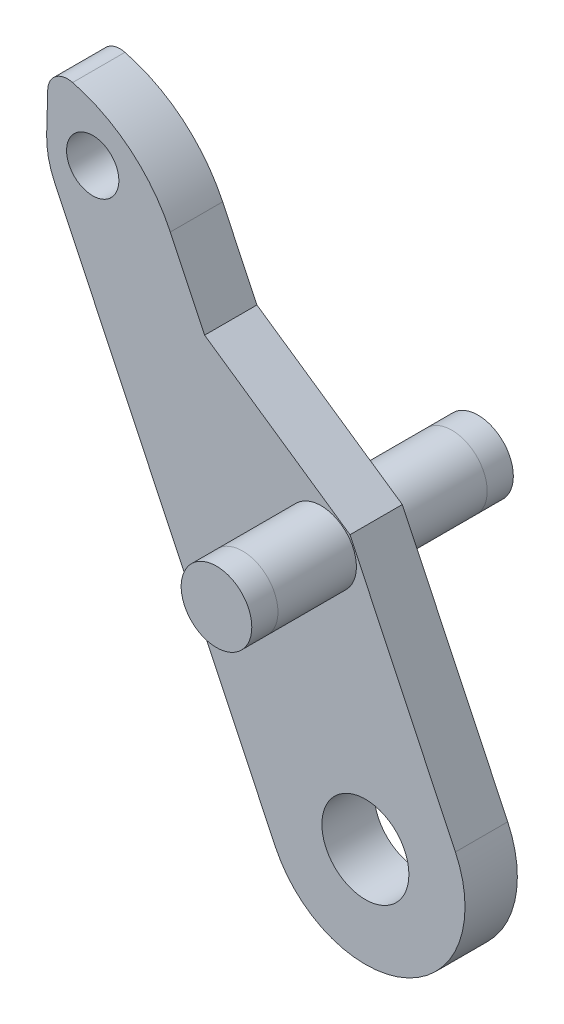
ISO-10303-21;
HEADER;
FILE_DESCRIPTION(('STEP AP214'),'2;1');
FILE_NAME('part.step','',(''),(''),'','','');
FILE_SCHEMA(('AUTOMOTIVE_DESIGN { 1 0 10303 214 1 1 1 1 }'));
ENDSEC;
DATA;
#1=APPLICATION_CONTEXT('core data for automotive mechanical design processes');
#2=APPLICATION_PROTOCOL_DEFINITION('international standard','automotive_design',2000,#1);
#3=PRODUCT_CONTEXT('',#1,'mechanical');
#4=PRODUCT('Part','Part','',(#3));
#5=PRODUCT_RELATED_PRODUCT_CATEGORY('part','',(#4));
#6=PRODUCT_DEFINITION_FORMATION('','',#4);
#7=PRODUCT_DEFINITION_CONTEXT('part definition',#1,'design');
#8=PRODUCT_DEFINITION('design','',#6,#7);
#9=PRODUCT_DEFINITION_SHAPE('','',#8);
#10=(LENGTH_UNIT() NAMED_UNIT(*) SI_UNIT(.MILLI.,.METRE.));
#11=(NAMED_UNIT(*) PLANE_ANGLE_UNIT() SI_UNIT($,.RADIAN.));
#12=(NAMED_UNIT(*) SI_UNIT($,.STERADIAN.) SOLID_ANGLE_UNIT());
#13=UNCERTAINTY_MEASURE_WITH_UNIT(LENGTH_MEASURE(1.E-05),#10,'distance_accuracy_value','');
#14=(GEOMETRIC_REPRESENTATION_CONTEXT(3) GLOBAL_UNCERTAINTY_ASSIGNED_CONTEXT((#13)) GLOBAL_UNIT_ASSIGNED_CONTEXT((#10,
#11,#12)) REPRESENTATION_CONTEXT('',''));
#15=CARTESIAN_POINT('',(0.,0.,0.));
#16=DIRECTION('',(0.,0.,1.));
#17=DIRECTION('',(1.,0.,0.));
#18=AXIS2_PLACEMENT_3D('',#15,#16,#17);
#19=CARTESIAN_POINT('',(101.996136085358,29.1759008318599,-5.));
#20=DIRECTION('',(0.,0.,1.));
#21=DIRECTION('',(1.,0.,0.));
#22=AXIS2_PLACEMENT_3D('',#19,#20,#21);
#23=CYLINDRICAL_SURFACE('',#22,1.35000000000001);
#24=CARTESIAN_POINT('',(101.996136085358,29.1759008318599,5.));
#25=DIRECTION('',(0.,0.,1.));
#26=DIRECTION('',(1.,0.,0.));
#27=AXIS2_PLACEMENT_3D('',#24,#25,#26);
#28=CIRCLE('',#27,1.35000000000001);
#29=CARTESIAN_POINT('',(103.346136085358,29.1759008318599,5.));
#30=VERTEX_POINT('',#29);
#31=EDGE_CURVE('E274',#30,#30,#28,.T.);
#32=ORIENTED_EDGE('',*,*,#31,.F.);
#33=EDGE_LOOP('',(#32));
#34=FACE_BOUND('',#33,.T.);
#35=CARTESIAN_POINT('',(101.996136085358,29.1759008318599,4.));
#36=DIRECTION('',(0.,0.,-1.));
#37=DIRECTION('',(0.,1.,0.));
#38=AXIS2_PLACEMENT_3D('',#35,#36,#37);
#39=CIRCLE('',#38,1.35000000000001);
#40=CARTESIAN_POINT('',(101.996136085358,30.5259008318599,4.));
#41=VERTEX_POINT('',#40);
#42=EDGE_CURVE('E11',#41,#41,#39,.F.);
#43=ORIENTED_EDGE('',*,*,#42,.T.);
#44=EDGE_LOOP('',(#43));
#45=FACE_BOUND('',#44,.T.);
#46=ADVANCED_FACE('F34',(#34,#45),#23,.T.);
#47=CARTESIAN_POINT('',(101.996136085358,29.1759008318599,-1.));
#48=DIRECTION('',(0.,0.,1.));
#49=DIRECTION('',(1.,0.,0.));
#50=AXIS2_PLACEMENT_3D('',#47,#48,#49);
#51=CIRCLE('',#50,1.35000000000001);
#52=CARTESIAN_POINT('',(103.346136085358,29.1759008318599,-1.));
#53=VERTEX_POINT('',#52);
#54=EDGE_CURVE('E176',#53,#53,#51,.T.);
#55=ORIENTED_EDGE('',*,*,#54,.F.);
#56=EDGE_LOOP('',(#55));
#57=FACE_BOUND('',#56,.T.);
#58=CARTESIAN_POINT('',(101.996136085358,29.1759008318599,-4.));
#59=DIRECTION('',(0.,0.,-1.));
#60=DIRECTION('',(0.,1.,0.));
#61=AXIS2_PLACEMENT_3D('',#58,#59,#60);
#62=CIRCLE('',#61,1.35000000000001);
#63=CARTESIAN_POINT('',(101.996136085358,30.5259008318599,-4.));
#64=VERTEX_POINT('',#63);
#65=EDGE_CURVE('E44',#64,#64,#62,.F.);
#66=ORIENTED_EDGE('',*,*,#65,.T.);
#67=EDGE_LOOP('',(#66));
#68=FACE_BOUND('',#67,.T.);
#69=ADVANCED_FACE('F242',(#57,#68),#23,.T.);
#70=CARTESIAN_POINT('',(91.0686021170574,34.2536540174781,1.));
#71=DIRECTION('',(0.,0.,1.));
#72=DIRECTION('',(1.,0.,0.));
#73=AXIS2_PLACEMENT_3D('',#70,#71,#72);
#74=PLANE('',#73);
#75=CARTESIAN_POINT('',(101.996136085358,29.1759008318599,1.));
#76=DIRECTION('',(0.,0.,1.));
#77=DIRECTION('',(1.,0.,0.));
#78=AXIS2_PLACEMENT_3D('',#75,#76,#77);
#79=CIRCLE('',#78,1.35000000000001);
#80=CARTESIAN_POINT('',(103.346136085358,29.1759008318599,1.));
#81=VERTEX_POINT('',#80);
#82=EDGE_CURVE('E175',#81,#81,#79,.T.);
#83=ORIENTED_EDGE('',*,*,#82,.F.);
#84=EDGE_LOOP('',(#83));
#85=FACE_BOUND('',#84,.T.);
#86=CARTESIAN_POINT('',(93.2637918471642,37.4210984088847,1.));
#87=DIRECTION('',(0.,0.,1.));
#88=DIRECTION('',(1.,0.,0.));
#89=AXIS2_PLACEMENT_3D('',#86,#87,#88);
#90=CIRCLE('',#89,0.999999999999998);
#91=CARTESIAN_POINT('',(94.2637918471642,37.4210984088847,1.));
#92=VERTEX_POINT('',#91);
#93=EDGE_CURVE('E178',#92,#92,#90,.T.);
#94=ORIENTED_EDGE('',*,*,#93,.F.);
#95=EDGE_LOOP('',(#94));
#96=FACE_BOUND('',#95,.T.);
#97=DIRECTION('',(-0.428935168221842,0.903335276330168,0.));
#98=VECTOR('',#97,1.);
#99=CARTESIAN_POINT('',(97.5421933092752,33.9439958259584,1.));
#100=LINE('',#99,#98);
#101=CARTESIAN_POINT('',(97.5421933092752,33.9439958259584,1.));
#102=VERTEX_POINT('',#101);
#103=CARTESIAN_POINT('',(96.2311632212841,36.7050185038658,1.));
#104=VERTEX_POINT('',#103);
#105=EDGE_CURVE('E157',#102,#104,#100,.T.);
#106=ORIENTED_EDGE('',*,*,#105,.T.);
#107=CARTESIAN_POINT('',(91.0686021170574,34.2536540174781,1.));
#108=DIRECTION('',(0.,0.,1.));
#109=DIRECTION('',(1.,0.,0.));
#110=AXIS2_PLACEMENT_3D('',#107,#108,#109);
#111=CIRCLE('',#110,5.71499999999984);
#112=CARTESIAN_POINT('',(92.496466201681,39.7874076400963,1.));
#113=VERTEX_POINT('',#112);
#114=EDGE_CURVE('E99',#104,#113,#111,.T.);
#115=ORIENTED_EDGE('',*,*,#114,.T.);
#116=CARTESIAN_POINT('',(92.3060843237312,39.0495738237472,1.));
#117=DIRECTION('',(0.,0.,1.));
#118=DIRECTION('',(1.,0.,0.));
#119=AXIS2_PLACEMENT_3D('',#116,#117,#118);
#120=CIRCLE('',#119,0.762000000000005);
#121=CARTESIAN_POINT('',(91.5443814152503,39.070850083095,1.));
#122=VERTEX_POINT('',#121);
#123=EDGE_CURVE('E205',#113,#122,#120,.T.);
#124=ORIENTED_EDGE('',*,*,#123,.T.);
#125=DIRECTION('',(-0.0279216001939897,-0.999610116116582,0.));
#126=VECTOR('',#125,1.);
#127=CARTESIAN_POINT('',(91.5443814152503,39.070850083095,1.));
#128=LINE('',#127,#126);
#129=CARTESIAN_POINT('',(91.5027565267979,37.580653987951,1.));
#130=VERTEX_POINT('',#129);
#131=EDGE_CURVE('E207',#122,#130,#128,.T.);
#132=ORIENTED_EDGE('',*,*,#131,.T.);
#133=CARTESIAN_POINT('',(94.6765186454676,37.4920029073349,1.));
#134=DIRECTION('',(0.,0.,1.));
#135=DIRECTION('',(1.,0.,0.));
#136=AXIS2_PLACEMENT_3D('',#133,#134,#135);
#137=CIRCLE('',#136,3.17499999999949);
#138=CARTESIAN_POINT('',(91.8084291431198,36.1301337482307,1.));
#139=VERTEX_POINT('',#138);
#140=EDGE_CURVE('E209',#130,#139,#137,.T.);
#141=ORIENTED_EDGE('',*,*,#140,.T.);
#142=DIRECTION('',(0.42893516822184,-0.903335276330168,0.));
#143=VECTOR('',#142,1.);
#144=CARTESIAN_POINT('',(91.8084291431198,36.1301337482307,1.));
#145=LINE('',#144,#143);
#146=CARTESIAN_POINT('',(100.247397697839,18.3577090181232,1.));
#147=VERTEX_POINT('',#146);
#148=EDGE_CURVE('E122',#139,#147,#145,.T.);
#149=ORIENTED_EDGE('',*,*,#148,.T.);
#150=CARTESIAN_POINT('',(103.689105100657,19.9919520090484,1.));
#151=DIRECTION('',(0.,0.,1.));
#152=DIRECTION('',(1.,0.,0.));
#153=AXIS2_PLACEMENT_3D('',#150,#151,#152);
#154=CIRCLE('',#153,3.80999999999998);
#155=CARTESIAN_POINT('',(107.130812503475,21.6261949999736,1.));
#156=VERTEX_POINT('',#155);
#157=EDGE_CURVE('E115',#147,#156,#154,.T.);
#158=ORIENTED_EDGE('',*,*,#157,.T.);
#159=DIRECTION('',(-0.428935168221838,0.90333527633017,0.));
#160=VECTOR('',#159,1.);
#161=CARTESIAN_POINT('',(107.130812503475,21.6261949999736,1.));
#162=LINE('',#161,#160);
#163=CARTESIAN_POINT('',(103.099679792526,30.1157399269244,1.));
#164=VERTEX_POINT('',#163);
#165=EDGE_CURVE('E120',#156,#164,#162,.T.);
#166=ORIENTED_EDGE('',*,*,#165,.T.);
#167=DIRECTION('',(-0.823523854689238,0.567281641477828,0.));
#168=VECTOR('',#167,1.);
#169=CARTESIAN_POINT('',(103.099679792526,30.1157399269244,1.));
#170=LINE('',#169,#168);
#171=EDGE_CURVE('E52',#164,#102,#170,.T.);
#172=ORIENTED_EDGE('',*,*,#171,.T.);
#173=EDGE_LOOP('',(#106,#115,#124,#132,#141,#149,#158,#166,#172));
#174=FACE_BOUND('',#173,.T.);
#175=CARTESIAN_POINT('',(103.689105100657,19.9919520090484,1.));
#176=DIRECTION('',(0.,0.,1.));
#177=DIRECTION('',(1.,0.,0.));
#178=AXIS2_PLACEMENT_3D('',#175,#176,#177);
#179=CIRCLE('',#178,1.6637);
#180=CARTESIAN_POINT('',(105.352805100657,19.9919520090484,1.));
#181=VERTEX_POINT('',#180);
#182=EDGE_CURVE('E144',#181,#181,#179,.T.);
#183=ORIENTED_EDGE('',*,*,#182,.F.);
#184=EDGE_LOOP('',(#183));
#185=FACE_BOUND('',#184,.T.);
#186=ADVANCED_FACE('F117',(#85,#96,#174,#185),#74,.T.);
#187=CARTESIAN_POINT('',(91.0686021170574,34.2536540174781,-1.));
#188=DIRECTION('',(0.,0.,1.));
#189=DIRECTION('',(1.,0.,0.));
#190=AXIS2_PLACEMENT_3D('',#187,#188,#189);
#191=PLANE('',#190);
#192=ORIENTED_EDGE('',*,*,#54,.T.);
#193=EDGE_LOOP('',(#192));
#194=FACE_BOUND('',#193,.T.);
#195=CARTESIAN_POINT('',(93.2637918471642,37.4210984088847,-1.));
#196=DIRECTION('',(0.,0.,1.));
#197=DIRECTION('',(1.,0.,0.));
#198=AXIS2_PLACEMENT_3D('',#195,#196,#197);
#199=CIRCLE('',#198,0.999999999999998);
#200=CARTESIAN_POINT('',(94.2637918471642,37.4210984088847,-1.));
#201=VERTEX_POINT('',#200);
#202=EDGE_CURVE('E193',#201,#201,#199,.T.);
#203=ORIENTED_EDGE('',*,*,#202,.T.);
#204=EDGE_LOOP('',(#203));
#205=FACE_BOUND('',#204,.T.);
#206=DIRECTION('',(-0.428935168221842,0.903335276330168,0.));
#207=VECTOR('',#206,1.);
#208=CARTESIAN_POINT('',(97.5421933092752,33.9439958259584,-1.));
#209=LINE('',#208,#207);
#210=CARTESIAN_POINT('',(97.5421933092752,33.9439958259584,-1.));
#211=VERTEX_POINT('',#210);
#212=CARTESIAN_POINT('',(96.2311632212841,36.7050185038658,-1.));
#213=VERTEX_POINT('',#212);
#214=EDGE_CURVE('E140',#211,#213,#209,.T.);
#215=ORIENTED_EDGE('',*,*,#214,.F.);
#216=DIRECTION('',(-0.823523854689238,0.567281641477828,0.));
#217=VECTOR('',#216,1.);
#218=CARTESIAN_POINT('',(103.099679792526,30.1157399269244,-1.));
#219=LINE('',#218,#217);
#220=CARTESIAN_POINT('',(103.099679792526,30.1157399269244,-1.));
#221=VERTEX_POINT('',#220);
#222=EDGE_CURVE('E90',#221,#211,#219,.T.);
#223=ORIENTED_EDGE('',*,*,#222,.F.);
#224=DIRECTION('',(-0.428935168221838,0.90333527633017,0.));
#225=VECTOR('',#224,1.);
#226=CARTESIAN_POINT('',(107.130812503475,21.6261949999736,-1.));
#227=LINE('',#226,#225);
#228=CARTESIAN_POINT('',(107.130812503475,21.6261949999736,-1.));
#229=VERTEX_POINT('',#228);
#230=EDGE_CURVE('E84',#229,#221,#227,.T.);
#231=ORIENTED_EDGE('',*,*,#230,.F.);
#232=CARTESIAN_POINT('',(103.689105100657,19.9919520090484,-1.));
#233=DIRECTION('',(0.,0.,1.));
#234=DIRECTION('',(1.,0.,0.));
#235=AXIS2_PLACEMENT_3D('',#232,#233,#234);
#236=CIRCLE('',#235,3.80999999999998);
#237=CARTESIAN_POINT('',(100.247397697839,18.3577090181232,-1.));
#238=VERTEX_POINT('',#237);
#239=EDGE_CURVE('E130',#238,#229,#236,.T.);
#240=ORIENTED_EDGE('',*,*,#239,.F.);
#241=DIRECTION('',(0.42893516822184,-0.903335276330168,0.));
#242=VECTOR('',#241,1.);
#243=CARTESIAN_POINT('',(91.8084291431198,36.1301337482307,-1.));
#244=LINE('',#243,#242);
#245=CARTESIAN_POINT('',(91.8084291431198,36.1301337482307,-1.));
#246=VERTEX_POINT('',#245);
#247=EDGE_CURVE('E152',#246,#238,#244,.T.);
#248=ORIENTED_EDGE('',*,*,#247,.F.);
#249=CARTESIAN_POINT('',(94.6765186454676,37.4920029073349,-1.));
#250=DIRECTION('',(0.,0.,1.));
#251=DIRECTION('',(1.,0.,0.));
#252=AXIS2_PLACEMENT_3D('',#249,#250,#251);
#253=CIRCLE('',#252,3.17499999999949);
#254=CARTESIAN_POINT('',(91.5027565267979,37.580653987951,-1.));
#255=VERTEX_POINT('',#254);
#256=EDGE_CURVE('E150',#255,#246,#253,.T.);
#257=ORIENTED_EDGE('',*,*,#256,.F.);
#258=DIRECTION('',(-0.0279216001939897,-0.999610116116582,0.));
#259=VECTOR('',#258,1.);
#260=CARTESIAN_POINT('',(91.5443814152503,39.070850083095,-1.));
#261=LINE('',#260,#259);
#262=CARTESIAN_POINT('',(91.5443814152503,39.070850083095,-1.));
#263=VERTEX_POINT('',#262);
#264=EDGE_CURVE('E148',#263,#255,#261,.T.);
#265=ORIENTED_EDGE('',*,*,#264,.F.);
#266=CARTESIAN_POINT('',(92.3060843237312,39.0495738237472,-1.));
#267=DIRECTION('',(0.,0.,1.));
#268=DIRECTION('',(1.,0.,0.));
#269=AXIS2_PLACEMENT_3D('',#266,#267,#268);
#270=CIRCLE('',#269,0.762000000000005);
#271=CARTESIAN_POINT('',(92.496466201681,39.7874076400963,-1.));
#272=VERTEX_POINT('',#271);
#273=EDGE_CURVE('E146',#272,#263,#270,.T.);
#274=ORIENTED_EDGE('',*,*,#273,.F.);
#275=CARTESIAN_POINT('',(91.0686021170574,34.2536540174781,-1.));
#276=DIRECTION('',(0.,0.,1.));
#277=DIRECTION('',(1.,0.,0.));
#278=AXIS2_PLACEMENT_3D('',#275,#276,#277);
#279=CIRCLE('',#278,5.71499999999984);
#280=EDGE_CURVE('E143',#213,#272,#279,.T.);
#281=ORIENTED_EDGE('',*,*,#280,.F.);
#282=EDGE_LOOP('',(#215,#223,#231,#240,#248,#257,#265,#274,#281));
#283=FACE_BOUND('',#282,.T.);
#284=CARTESIAN_POINT('',(103.689105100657,19.9919520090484,-1.));
#285=DIRECTION('',(0.,0.,1.));
#286=DIRECTION('',(1.,0.,0.));
#287=AXIS2_PLACEMENT_3D('',#284,#285,#286);
#288=CIRCLE('',#287,1.6637);
#289=CARTESIAN_POINT('',(105.352805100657,19.9919520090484,-1.));
#290=VERTEX_POINT('',#289);
#291=EDGE_CURVE('E196',#290,#290,#288,.T.);
#292=ORIENTED_EDGE('',*,*,#291,.T.);
#293=EDGE_LOOP('',(#292));
#294=FACE_BOUND('',#293,.T.);
#295=ADVANCED_FACE('F222',(#194,#205,#283,#294),#191,.F.);
#296=CARTESIAN_POINT('',(97.5421933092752,33.9439958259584,1.));
#297=DIRECTION('',(-0.903335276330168,-0.428935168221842,0.));
#298=DIRECTION('',(0.428935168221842,-0.903335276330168,0.));
#299=AXIS2_PLACEMENT_3D('',#296,#297,#298);
#300=PLANE('',#299);
#301=ORIENTED_EDGE('',*,*,#214,.T.);
#302=DIRECTION('',(0.,0.,-1.));
#303=VECTOR('',#302,1.);
#304=CARTESIAN_POINT('',(96.2311632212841,36.7050185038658,1.));
#305=LINE('',#304,#303);
#306=EDGE_CURVE('E173',#104,#213,#305,.T.);
#307=ORIENTED_EDGE('',*,*,#306,.F.);
#308=ORIENTED_EDGE('',*,*,#105,.F.);
#309=DIRECTION('',(0.,0.,-1.));
#310=VECTOR('',#309,1.);
#311=CARTESIAN_POINT('',(97.5421933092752,33.9439958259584,1.));
#312=LINE('',#311,#310);
#313=EDGE_CURVE('E136',#102,#211,#312,.T.);
#314=ORIENTED_EDGE('',*,*,#313,.T.);
#315=EDGE_LOOP('',(#301,#307,#308,#314));
#316=FACE_BOUND('',#315,.T.);
#317=ADVANCED_FACE('F36',(#316),#300,.F.);
#318=CARTESIAN_POINT('',(91.0686021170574,34.2536540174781,1.));
#319=DIRECTION('',(0.,0.,-1.));
#320=DIRECTION('',(-1.,0.,0.));
#321=AXIS2_PLACEMENT_3D('',#318,#319,#320);
#322=CYLINDRICAL_SURFACE('',#321,5.71499999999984);
#323=ORIENTED_EDGE('',*,*,#280,.T.);
#324=DIRECTION('',(0.,0.,-1.));
#325=VECTOR('',#324,1.);
#326=CARTESIAN_POINT('',(92.496466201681,39.7874076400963,1.));
#327=LINE('',#326,#325);
#328=EDGE_CURVE('E170',#113,#272,#327,.T.);
#329=ORIENTED_EDGE('',*,*,#328,.F.);
#330=ORIENTED_EDGE('',*,*,#114,.F.);
#331=ORIENTED_EDGE('',*,*,#306,.T.);
#332=EDGE_LOOP('',(#323,#329,#330,#331));
#333=FACE_BOUND('',#332,.T.);
#334=ADVANCED_FACE('F292',(#333),#322,.T.);
#335=CARTESIAN_POINT('',(92.3060843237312,39.0495738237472,1.));
#336=DIRECTION('',(0.,0.,-1.));
#337=DIRECTION('',(-1.,0.,0.));
#338=AXIS2_PLACEMENT_3D('',#335,#336,#337);
#339=CYLINDRICAL_SURFACE('',#338,0.762000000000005);
#340=ORIENTED_EDGE('',*,*,#273,.T.);
#341=DIRECTION('',(0.,0.,-1.));
#342=VECTOR('',#341,1.);
#343=CARTESIAN_POINT('',(91.5443814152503,39.070850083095,1.));
#344=LINE('',#343,#342);
#345=EDGE_CURVE('E167',#122,#263,#344,.T.);
#346=ORIENTED_EDGE('',*,*,#345,.F.);
#347=ORIENTED_EDGE('',*,*,#123,.F.);
#348=ORIENTED_EDGE('',*,*,#328,.T.);
#349=EDGE_LOOP('',(#340,#346,#347,#348));
#350=FACE_BOUND('',#349,.T.);
#351=ADVANCED_FACE('F298',(#350),#339,.T.);
#352=CARTESIAN_POINT('',(91.5443814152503,39.070850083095,1.));
#353=DIRECTION('',(0.999610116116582,-0.0279216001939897,0.));
#354=DIRECTION('',(0.0279216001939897,0.999610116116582,0.));
#355=AXIS2_PLACEMENT_3D('',#352,#353,#354);
#356=PLANE('',#355);
#357=ORIENTED_EDGE('',*,*,#264,.T.);
#358=DIRECTION('',(0.,0.,-1.));
#359=VECTOR('',#358,1.);
#360=CARTESIAN_POINT('',(91.5027565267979,37.580653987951,1.));
#361=LINE('',#360,#359);
#362=EDGE_CURVE('E164',#130,#255,#361,.T.);
#363=ORIENTED_EDGE('',*,*,#362,.F.);
#364=ORIENTED_EDGE('',*,*,#131,.F.);
#365=ORIENTED_EDGE('',*,*,#345,.T.);
#366=EDGE_LOOP('',(#357,#363,#364,#365));
#367=FACE_BOUND('',#366,.T.);
#368=ADVANCED_FACE('F302',(#367),#356,.F.);
#369=CARTESIAN_POINT('',(94.6765186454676,37.4920029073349,1.));
#370=DIRECTION('',(0.,0.,-1.));
#371=DIRECTION('',(-1.,0.,0.));
#372=AXIS2_PLACEMENT_3D('',#369,#370,#371);
#373=CYLINDRICAL_SURFACE('',#372,3.17499999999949);
#374=ORIENTED_EDGE('',*,*,#256,.T.);
#375=DIRECTION('',(0.,0.,-1.));
#376=VECTOR('',#375,1.);
#377=CARTESIAN_POINT('',(91.8084291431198,36.1301337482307,1.));
#378=LINE('',#377,#376);
#379=EDGE_CURVE('E161',#139,#246,#378,.T.);
#380=ORIENTED_EDGE('',*,*,#379,.F.);
#381=ORIENTED_EDGE('',*,*,#140,.F.);
#382=ORIENTED_EDGE('',*,*,#362,.T.);
#383=EDGE_LOOP('',(#374,#380,#381,#382));
#384=FACE_BOUND('',#383,.T.);
#385=ADVANCED_FACE('F215',(#384),#373,.T.);
#386=CARTESIAN_POINT('',(91.8084291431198,36.1301337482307,1.));
#387=DIRECTION('',(0.903335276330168,0.42893516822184,0.));
#388=DIRECTION('',(-0.42893516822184,0.903335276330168,0.));
#389=AXIS2_PLACEMENT_3D('',#386,#387,#388);
#390=PLANE('',#389);
#391=ORIENTED_EDGE('',*,*,#247,.T.);
#392=DIRECTION('',(0.,0.,-1.));
#393=VECTOR('',#392,1.);
#394=CARTESIAN_POINT('',(100.247397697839,18.3577090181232,1.));
#395=LINE('',#394,#393);
#396=EDGE_CURVE('E131',#147,#238,#395,.T.);
#397=ORIENTED_EDGE('',*,*,#396,.F.);
#398=ORIENTED_EDGE('',*,*,#148,.F.);
#399=ORIENTED_EDGE('',*,*,#379,.T.);
#400=EDGE_LOOP('',(#391,#397,#398,#399));
#401=FACE_BOUND('',#400,.T.);
#402=ADVANCED_FACE('F219',(#401),#390,.F.);
#403=CARTESIAN_POINT('',(103.689105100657,19.9919520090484,1.));
#404=DIRECTION('',(0.,0.,-1.));
#405=DIRECTION('',(-1.,0.,0.));
#406=AXIS2_PLACEMENT_3D('',#403,#404,#405);
#407=CYLINDRICAL_SURFACE('',#406,3.80999999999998);
#408=ORIENTED_EDGE('',*,*,#239,.T.);
#409=DIRECTION('',(0.,0.,-1.));
#410=VECTOR('',#409,1.);
#411=CARTESIAN_POINT('',(107.130812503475,21.6261949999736,1.));
#412=LINE('',#411,#410);
#413=EDGE_CURVE('E127',#156,#229,#412,.T.);
#414=ORIENTED_EDGE('',*,*,#413,.F.);
#415=ORIENTED_EDGE('',*,*,#157,.F.);
#416=ORIENTED_EDGE('',*,*,#396,.T.);
#417=EDGE_LOOP('',(#408,#414,#415,#416));
#418=FACE_BOUND('',#417,.T.);
#419=ADVANCED_FACE('F128',(#418),#407,.T.);
#420=CARTESIAN_POINT('',(107.130812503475,21.6261949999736,1.));
#421=DIRECTION('',(-0.903335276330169,-0.428935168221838,0.));
#422=DIRECTION('',(0.428935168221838,-0.903335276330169,0.));
#423=AXIS2_PLACEMENT_3D('',#420,#421,#422);
#424=PLANE('',#423);
#425=ORIENTED_EDGE('',*,*,#230,.T.);
#426=DIRECTION('',(0.,0.,-1.));
#427=VECTOR('',#426,1.);
#428=CARTESIAN_POINT('',(103.099679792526,30.1157399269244,1.));
#429=LINE('',#428,#427);
#430=EDGE_CURVE('E132',#164,#221,#429,.T.);
#431=ORIENTED_EDGE('',*,*,#430,.F.);
#432=ORIENTED_EDGE('',*,*,#165,.F.);
#433=ORIENTED_EDGE('',*,*,#413,.T.);
#434=EDGE_LOOP('',(#425,#431,#432,#433));
#435=FACE_BOUND('',#434,.T.);
#436=ADVANCED_FACE('F134',(#435),#424,.F.);
#437=CARTESIAN_POINT('',(103.099679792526,30.1157399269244,1.));
#438=DIRECTION('',(-0.567281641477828,-0.823523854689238,0.));
#439=DIRECTION('',(0.823523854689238,-0.567281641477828,0.));
#440=AXIS2_PLACEMENT_3D('',#437,#438,#439);
#441=PLANE('',#440);
#442=ORIENTED_EDGE('',*,*,#222,.T.);
#443=ORIENTED_EDGE('',*,*,#313,.F.);
#444=ORIENTED_EDGE('',*,*,#171,.F.);
#445=ORIENTED_EDGE('',*,*,#430,.T.);
#446=EDGE_LOOP('',(#442,#443,#444,#445));
#447=FACE_BOUND('',#446,.T.);
#448=ADVANCED_FACE('F228',(#447),#441,.F.);
#449=CARTESIAN_POINT('',(103.689105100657,19.9919520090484,1.));
#450=DIRECTION('',(0.,0.,-1.));
#451=DIRECTION('',(-1.,0.,0.));
#452=AXIS2_PLACEMENT_3D('',#449,#450,#451);
#453=CYLINDRICAL_SURFACE('',#452,1.6637);
#454=ORIENTED_EDGE('',*,*,#182,.T.);
#455=EDGE_LOOP('',(#454));
#456=FACE_BOUND('',#455,.T.);
#457=ORIENTED_EDGE('',*,*,#291,.F.);
#458=EDGE_LOOP('',(#457));
#459=FACE_BOUND('',#458,.T.);
#460=ADVANCED_FACE('F230',(#456,#459),#453,.F.);
#461=CARTESIAN_POINT('',(93.2637918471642,37.4210984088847,-1.));
#462=DIRECTION('',(0.,0.,1.));
#463=DIRECTION('',(1.,0.,0.));
#464=AXIS2_PLACEMENT_3D('',#461,#462,#463);
#465=CYLINDRICAL_SURFACE('',#464,0.999999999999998);
#466=ORIENTED_EDGE('',*,*,#202,.F.);
#467=EDGE_LOOP('',(#466));
#468=FACE_BOUND('',#467,.T.);
#469=ORIENTED_EDGE('',*,*,#93,.T.);
#470=EDGE_LOOP('',(#469));
#471=FACE_BOUND('',#470,.T.);
#472=ADVANCED_FACE('F236',(#468,#471),#465,.F.);
#473=CARTESIAN_POINT('',(101.996136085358,29.1759008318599,-5.));
#474=DIRECTION('',(0.,0.,1.));
#475=DIRECTION('',(1.,0.,0.));
#476=AXIS2_PLACEMENT_3D('',#473,#474,#475);
#477=PLANE('',#476);
#478=CARTESIAN_POINT('',(101.996136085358,29.1759008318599,-5.));
#479=DIRECTION('',(0.,0.,1.));
#480=DIRECTION('',(1.,0.,0.));
#481=AXIS2_PLACEMENT_3D('',#478,#479,#480);
#482=CIRCLE('',#481,1.35000000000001);
#483=CARTESIAN_POINT('',(103.346136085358,29.1759008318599,-5.));
#484=VERTEX_POINT('',#483);
#485=EDGE_CURVE('E179',#484,#484,#482,.T.);
#486=ORIENTED_EDGE('',*,*,#485,.F.);
#487=EDGE_LOOP('',(#486));
#488=FACE_BOUND('',#487,.T.);
#489=ADVANCED_FACE('F264',(#488),#477,.F.);
#490=ORIENTED_EDGE('',*,*,#65,.F.);
#491=EDGE_LOOP('',(#490));
#492=FACE_BOUND('',#491,.T.);
#493=ORIENTED_EDGE('',*,*,#485,.T.);
#494=EDGE_LOOP('',(#493));
#495=FACE_BOUND('',#494,.T.);
#496=ADVANCED_FACE('F250',(#492,#495),#23,.T.);
#497=ORIENTED_EDGE('',*,*,#42,.F.);
#498=EDGE_LOOP('',(#497));
#499=FACE_BOUND('',#498,.T.);
#500=ORIENTED_EDGE('',*,*,#82,.T.);
#501=EDGE_LOOP('',(#500));
#502=FACE_BOUND('',#501,.T.);
#503=ADVANCED_FACE('F245',(#499,#502),#23,.T.);
#504=CARTESIAN_POINT('',(101.996136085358,29.1759008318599,5.));
#505=DIRECTION('',(0.,0.,1.));
#506=DIRECTION('',(1.,0.,0.));
#507=AXIS2_PLACEMENT_3D('',#504,#505,#506);
#508=PLANE('',#507);
#509=ORIENTED_EDGE('',*,*,#31,.T.);
#510=EDGE_LOOP('',(#509));
#511=FACE_BOUND('',#510,.T.);
#512=ADVANCED_FACE('F256',(#511),#508,.T.);
#513=CLOSED_SHELL('',(#46,#69,#186,#295,#317,#334,#351,#368,#385,#402,#419,#436,#448,#460,#472,
#489,#496,#503,#512));
#514=MANIFOLD_SOLID_BREP('B2',#513);
#515=ADVANCED_BREP_SHAPE_REPRESENTATION('',(#18,#514),#14);
#516=SHAPE_DEFINITION_REPRESENTATION(#9,#515);
ENDSEC;
END-ISO-10303-21;
